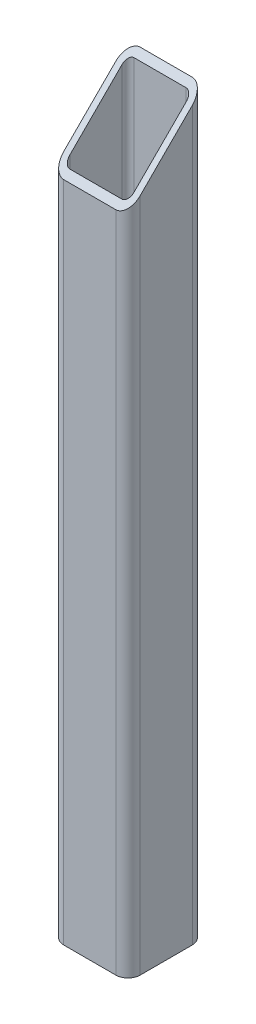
from build123d import *

# Parameters (mm, degrees)
EXTRUDE_THIN1_DEPTH = 368.3
EXTRUDE1_DEPTH      = 371.755178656


with BuildPart() as part:
    # Sketch1 → Extrude-Thin1 (new body)
    with BuildSketch(Plane(origin=(0, 0, 0), x_dir=(1, 0, 0), z_dir=(0, 1, 0))):
        with BuildLine():
            Line((19.05, 12.97432), (19.05, -12.97432))
            ThreePointArc((19.05, -12.97432), (17.270474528, -17.270474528), (12.97432, -19.05))
            Line((12.97432, -19.05), (-12.97432, -19.05))
            ThreePointArc((-12.97432, -19.05), (-17.270474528, -17.270474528), (-19.05, -12.97432))
            Line((-19.05, -12.97432), (-19.05, 12.97432))
            ThreePointArc((-19.05, 12.97432), (-17.270474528, 17.270474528), (-12.97432, 19.05))
            Line((-12.97432, 19.05), (12.97432, 19.05))
            ThreePointArc((12.97432, 19.05), (17.270474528, 17.270474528), (19.05, 12.97432))
        make_face()
        with BuildLine():
            Line((16.01216, 12.97432), (16.01216, -12.97432))
            ThreePointArc((16.01216, -12.97432), (15.122397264, -15.122397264), (12.97432, -16.01216))
            Line((12.97432, -16.01216), (-12.97432, -16.01216))
            ThreePointArc((-12.97432, -16.01216), (-15.122397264, -15.122397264), (-16.01216, -12.97432))
            Line((-16.01216, -12.97432), (-16.01216, 12.97432))
            ThreePointArc((-16.01216, 12.97432), (-15.122397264, 15.122397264), (-12.97432, 16.01216))
            Line((-12.97432, 16.01216), (12.97432, 16.01216))
            ThreePointArc((12.97432, 16.01216), (15.122397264, 15.122397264), (16.01216, 12.97432))
        make_face(mode=Mode.SUBTRACT)
    extrude(amount=EXTRUDE_THIN1_DEPTH)

    # Sketch2 → Extrude1 (cut, through all)
    with BuildSketch(Plane.ZY.offset(19.05)):
        Polygon((-549.755482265, 899.005482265), (-19.05, 368.3), (19.05, 330.2), (549.755482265, -200.505482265), (1611.166446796, 860.905482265), (511.655482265, 1960.416446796), align=None)
    extrude(amount=-EXTRUDE1_DEPTH, mode=Mode.SUBTRACT)


solid = part.part
